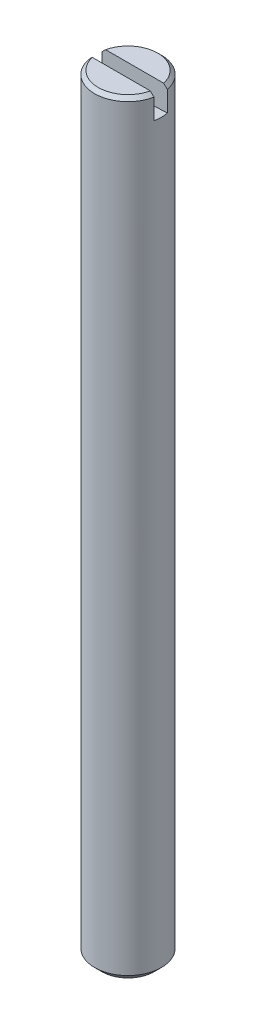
ISO-10303-21;
HEADER;
FILE_DESCRIPTION(('STEP AP214'),'2;1');
FILE_NAME('part.step','',(''),(''),'','','');
FILE_SCHEMA(('AUTOMOTIVE_DESIGN { 1 0 10303 214 1 1 1 1 }'));
ENDSEC;
DATA;
#1=APPLICATION_CONTEXT('core data for automotive mechanical design processes');
#2=APPLICATION_PROTOCOL_DEFINITION('international standard','automotive_design',2000,#1);
#3=PRODUCT_CONTEXT('',#1,'mechanical');
#4=PRODUCT('Part','Part','',(#3));
#5=PRODUCT_RELATED_PRODUCT_CATEGORY('part','',(#4));
#6=PRODUCT_DEFINITION_FORMATION('','',#4);
#7=PRODUCT_DEFINITION_CONTEXT('part definition',#1,'design');
#8=PRODUCT_DEFINITION('design','',#6,#7);
#9=PRODUCT_DEFINITION_SHAPE('','',#8);
#10=(LENGTH_UNIT() NAMED_UNIT(*) SI_UNIT(.MILLI.,.METRE.));
#11=(NAMED_UNIT(*) PLANE_ANGLE_UNIT() SI_UNIT($,.RADIAN.));
#12=(NAMED_UNIT(*) SI_UNIT($,.STERADIAN.) SOLID_ANGLE_UNIT());
#13=UNCERTAINTY_MEASURE_WITH_UNIT(LENGTH_MEASURE(1.E-05),#10,'distance_accuracy_value','');
#14=(GEOMETRIC_REPRESENTATION_CONTEXT(3) GLOBAL_UNCERTAINTY_ASSIGNED_CONTEXT((#13)) GLOBAL_UNIT_ASSIGNED_CONTEXT((#10,
#11,#12)) REPRESENTATION_CONTEXT('',''));
#15=CARTESIAN_POINT('',(0.,0.,0.));
#16=DIRECTION('',(0.,0.,1.));
#17=DIRECTION('',(1.,0.,0.));
#18=AXIS2_PLACEMENT_3D('',#15,#16,#17);
#19=CARTESIAN_POINT('',(0.,31.,0.));
#20=DIRECTION('',(0.,-1.,0.));
#21=DIRECTION('',(0.,0.,-1.));
#22=AXIS2_PLACEMENT_3D('',#19,#20,#21);
#23=PLANE('',#22);
#24=CARTESIAN_POINT('',(0.,31.0000000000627,0.));
#25=DIRECTION('',(0.,-1.,0.));
#26=DIRECTION('',(0.,0.,-1.));
#27=AXIS2_PLACEMENT_3D('',#24,#25,#26);
#28=CIRCLE('',#27,1.78549999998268);
#29=CARTESIAN_POINT('',(-1.74011788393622,31.0000000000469,-0.4));
#30=VERTEX_POINT('',#29);
#31=CARTESIAN_POINT('',(1.74011788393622,31.0000000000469,-0.4));
#32=VERTEX_POINT('',#31);
#33=EDGE_CURVE('E87',#30,#32,#28,.T.);
#34=ORIENTED_EDGE('',*,*,#33,.F.);
#35=DIRECTION('',(1.,0.,0.));
#36=VECTOR('',#35,1.);
#37=CARTESIAN_POINT('',(0.,31.,-0.4));
#38=LINE('',#37,#36);
#39=EDGE_CURVE('E19',#32,#30,#38,.F.);
#40=ORIENTED_EDGE('',*,*,#39,.F.);
#41=EDGE_LOOP('',(#34,#40));
#42=FACE_BOUND('',#41,.T.);
#43=ADVANCED_FACE('F14',(#42),#23,.F.);
#44=CARTESIAN_POINT('',(0.,31.,0.));
#45=DIRECTION('',(0.,-1.,0.));
#46=DIRECTION('',(0.,0.,-1.));
#47=AXIS2_PLACEMENT_3D('',#44,#45,#46);
#48=PLANE('',#47);
#49=DIRECTION('',(1.,0.,0.));
#50=VECTOR('',#49,1.);
#51=CARTESIAN_POINT('',(0.,31.,0.4));
#52=LINE('',#51,#50);
#53=CARTESIAN_POINT('',(-1.74011788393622,31.0000000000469,0.4));
#54=VERTEX_POINT('',#53);
#55=CARTESIAN_POINT('',(1.74011788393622,31.0000000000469,0.4));
#56=VERTEX_POINT('',#55);
#57=EDGE_CURVE('E81',#54,#56,#52,.T.);
#58=ORIENTED_EDGE('',*,*,#57,.F.);
#59=CARTESIAN_POINT('',(0.,31.0000000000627,0.));
#60=DIRECTION('',(0.,-1.,0.));
#61=DIRECTION('',(0.,0.,-1.));
#62=AXIS2_PLACEMENT_3D('',#59,#60,#61);
#63=CIRCLE('',#62,1.78549999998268);
#64=EDGE_CURVE('E74',#56,#54,#63,.T.);
#65=ORIENTED_EDGE('',*,*,#64,.F.);
#66=EDGE_LOOP('',(#58,#65));
#67=FACE_BOUND('',#66,.T.);
#68=ADVANCED_FACE('F86',(#67),#48,.F.);
#69=CARTESIAN_POINT('',(0.,30.7855000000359,0.));
#70=DIRECTION('',(0.,-1.,0.));
#71=DIRECTION('',(0.,0.,-1.));
#72=AXIS2_PLACEMENT_3D('',#69,#70,#71);
#73=CONICAL_SURFACE('',#72,1.9999999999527,0.785398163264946);
#74=CARTESIAN_POINT('',(-1.74011788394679,31.0000000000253,-0.399999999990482));
#75=CARTESIAN_POINT('',(-1.77674437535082,30.964298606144,-0.399999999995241));
#76=CARTESIAN_POINT('',(-1.8133471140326,30.928572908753,-0.399999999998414));
#77=CARTESIAN_POINT('',(-1.88650508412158,30.8570729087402,-0.400000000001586));
#78=CARTESIAN_POINT('',(-1.92306031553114,30.8212986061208,-0.400000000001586));
#79=CARTESIAN_POINT('',(-1.95959179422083,30.7854999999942,-0.4));
#80=B_SPLINE_CURVE_WITH_KNOTS('',3,(#74,#75,#76,#77,#78,#79),.UNSPECIFIED.,.F.,.F.,(4,2,4),(0.,
0.153443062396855,0.306886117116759),.UNSPECIFIED.);
#81=CARTESIAN_POINT('',(-1.95959179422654,30.7854999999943,-0.4));
#82=VERTEX_POINT('',#81);
#83=EDGE_CURVE('E85',#30,#82,#80,.T.);
#84=ORIENTED_EDGE('',*,*,#83,.F.);
#85=ORIENTED_EDGE('',*,*,#33,.T.);
#86=CARTESIAN_POINT('',(1.95959179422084,30.7854999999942,-0.4));
#87=CARTESIAN_POINT('',(1.9230603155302,30.8212986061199,-0.4));
#88=CARTESIAN_POINT('',(1.88650508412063,30.8570729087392,-0.4));
#89=CARTESIAN_POINT('',(1.81334711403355,30.9285729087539,-0.4));
#90=CARTESIAN_POINT('',(1.77674437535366,30.9642986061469,-0.4));
#91=CARTESIAN_POINT('',(1.74011788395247,31.0000000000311,-0.4));
#92=B_SPLINE_CURVE_WITH_KNOTS('',3,(#86,#87,#88,#89,#90,#91),.UNSPECIFIED.,.F.,.F.,(4,2,4),(0.,
0.153443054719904,0.306886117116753),.UNSPECIFIED.);
#93=CARTESIAN_POINT('',(1.95959179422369,30.7854999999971,-0.4));
#94=VERTEX_POINT('',#93);
#95=EDGE_CURVE('E112',#94,#32,#92,.T.);
#96=ORIENTED_EDGE('',*,*,#95,.F.);
#97=CARTESIAN_POINT('',(0.,30.7855,0.));
#98=DIRECTION('',(0.,-1.,0.));
#99=DIRECTION('',(0.,0.,-1.));
#100=AXIS2_PLACEMENT_3D('',#97,#98,#99);
#101=CIRCLE('',#100,2.);
#102=EDGE_CURVE('E101',#82,#94,#101,.T.);
#103=ORIENTED_EDGE('',*,*,#102,.F.);
#104=EDGE_LOOP('',(#84,#85,#96,#103));
#105=FACE_BOUND('',#104,.T.);
#106=ADVANCED_FACE('F128',(#105),#73,.T.);
#107=CARTESIAN_POINT('',(0.,61.,-0.4));
#108=DIRECTION('',(0.,0.,1.));
#109=DIRECTION('',(1.,0.,0.));
#110=AXIS2_PLACEMENT_3D('',#107,#108,#109);
#111=PLANE('',#110);
#112=ORIENTED_EDGE('',*,*,#39,.T.);
#113=ORIENTED_EDGE('',*,*,#83,.T.);
#114=DIRECTION('',(0.,1.,0.));
#115=VECTOR('',#114,1.);
#116=CARTESIAN_POINT('',(-1.95959179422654,61.,-0.4));
#117=LINE('',#116,#115);
#118=CARTESIAN_POINT('',(-1.95959179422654,29.5610114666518,-0.4));
#119=VERTEX_POINT('',#118);
#120=EDGE_CURVE('E58',#82,#119,#117,.F.);
#121=ORIENTED_EDGE('',*,*,#120,.T.);
#122=CARTESIAN_POINT('',(0.,61.,-0.4));
#123=DIRECTION('',(0.,0.,-1.));
#124=DIRECTION('',(-1.,0.,0.));
#125=AXIS2_PLACEMENT_3D('',#122,#123,#124);
#126=CIRCLE('',#125,31.5);
#127=CARTESIAN_POINT('',(1.95959179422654,29.5610114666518,-0.4));
#128=VERTEX_POINT('',#127);
#129=EDGE_CURVE('E109',#119,#128,#126,.F.);
#130=ORIENTED_EDGE('',*,*,#129,.T.);
#131=DIRECTION('',(0.,1.,0.));
#132=VECTOR('',#131,1.);
#133=CARTESIAN_POINT('',(1.95959179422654,61.,-0.4));
#134=LINE('',#133,#132);
#135=EDGE_CURVE('E110',#128,#94,#134,.T.);
#136=ORIENTED_EDGE('',*,*,#135,.T.);
#137=ORIENTED_EDGE('',*,*,#95,.T.);
#138=EDGE_LOOP('',(#112,#113,#121,#130,#136,#137));
#139=FACE_BOUND('',#138,.T.);
#140=ADVANCED_FACE('F124',(#139),#111,.T.);
#141=CARTESIAN_POINT('',(0.,30.7855000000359,0.));
#142=DIRECTION('',(0.,-1.,0.));
#143=DIRECTION('',(0.,0.,-1.));
#144=AXIS2_PLACEMENT_3D('',#141,#142,#143);
#145=CONICAL_SURFACE('',#144,1.9999999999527,0.785398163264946);
#146=ORIENTED_EDGE('',*,*,#64,.T.);
#147=CARTESIAN_POINT('',(-1.74011788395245,31.0000000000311,0.4));
#148=CARTESIAN_POINT('',(-1.77674437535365,30.9642986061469,0.4));
#149=CARTESIAN_POINT('',(-1.81334711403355,30.928572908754,0.4));
#150=CARTESIAN_POINT('',(-1.88650508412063,30.8570729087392,0.4));
#151=CARTESIAN_POINT('',(-1.9230603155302,30.8212986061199,0.4));
#152=CARTESIAN_POINT('',(-1.95959179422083,30.7854999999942,0.4));
#153=B_SPLINE_CURVE_WITH_KNOTS('',3,(#147,#148,#149,#150,#151,#152),.UNSPECIFIED.,.F.,.F.,(4,2,
4),(0.,0.153443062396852,0.306886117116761),.UNSPECIFIED.);
#154=CARTESIAN_POINT('',(-1.95959179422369,30.7854999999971,0.4));
#155=VERTEX_POINT('',#154);
#156=EDGE_CURVE('E34',#54,#155,#153,.T.);
#157=ORIENTED_EDGE('',*,*,#156,.T.);
#158=CARTESIAN_POINT('',(0.,30.7855,0.));
#159=DIRECTION('',(0.,-1.,0.));
#160=DIRECTION('',(0.,0.,-1.));
#161=AXIS2_PLACEMENT_3D('',#158,#159,#160);
#162=CIRCLE('',#161,2.);
#163=CARTESIAN_POINT('',(1.95959179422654,30.7854999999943,0.4));
#164=VERTEX_POINT('',#163);
#165=EDGE_CURVE('E75',#164,#155,#162,.T.);
#166=ORIENTED_EDGE('',*,*,#165,.F.);
#167=CARTESIAN_POINT('',(1.95959179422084,30.7854999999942,0.4));
#168=CARTESIAN_POINT('',(1.9230603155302,30.8212986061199,0.4));
#169=CARTESIAN_POINT('',(1.88650508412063,30.8570729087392,0.4));
#170=CARTESIAN_POINT('',(1.81334711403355,30.928572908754,0.4));
#171=CARTESIAN_POINT('',(1.77674437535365,30.9642986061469,0.4));
#172=CARTESIAN_POINT('',(1.74011788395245,31.0000000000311,0.4));
#173=B_SPLINE_CURVE_WITH_KNOTS('',3,(#167,#168,#169,#170,#171,#172),.UNSPECIFIED.,.F.,.F.,(4,2,
4),(0.,0.153443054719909,0.306886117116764),.UNSPECIFIED.);
#174=EDGE_CURVE('E70',#164,#56,#173,.T.);
#175=ORIENTED_EDGE('',*,*,#174,.T.);
#176=EDGE_LOOP('',(#146,#157,#166,#175));
#177=FACE_BOUND('',#176,.T.);
#178=ADVANCED_FACE('F72',(#177),#145,.T.);
#179=CARTESIAN_POINT('',(0.,61.,0.4));
#180=DIRECTION('',(0.,0.,1.));
#181=DIRECTION('',(1.,0.,0.));
#182=AXIS2_PLACEMENT_3D('',#179,#180,#181);
#183=PLANE('',#182);
#184=ORIENTED_EDGE('',*,*,#57,.T.);
#185=ORIENTED_EDGE('',*,*,#174,.F.);
#186=DIRECTION('',(0.,1.,0.));
#187=VECTOR('',#186,1.);
#188=CARTESIAN_POINT('',(1.95959179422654,61.,0.4));
#189=LINE('',#188,#187);
#190=CARTESIAN_POINT('',(1.95959179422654,29.5610114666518,0.4));
#191=VERTEX_POINT('',#190);
#192=EDGE_CURVE('E78',#191,#164,#189,.T.);
#193=ORIENTED_EDGE('',*,*,#192,.F.);
#194=CARTESIAN_POINT('',(0.,61.,0.4));
#195=DIRECTION('',(0.,0.,-1.));
#196=DIRECTION('',(-1.,0.,0.));
#197=AXIS2_PLACEMENT_3D('',#194,#195,#196);
#198=CIRCLE('',#197,31.5);
#199=CARTESIAN_POINT('',(-1.95959179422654,29.5610114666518,0.4));
#200=VERTEX_POINT('',#199);
#201=EDGE_CURVE('E106',#200,#191,#198,.F.);
#202=ORIENTED_EDGE('',*,*,#201,.F.);
#203=DIRECTION('',(0.,1.,0.));
#204=VECTOR('',#203,1.);
#205=CARTESIAN_POINT('',(-1.95959179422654,61.,0.4));
#206=LINE('',#205,#204);
#207=EDGE_CURVE('E104',#155,#200,#206,.F.);
#208=ORIENTED_EDGE('',*,*,#207,.F.);
#209=ORIENTED_EDGE('',*,*,#156,.F.);
#210=EDGE_LOOP('',(#184,#185,#193,#202,#208,#209));
#211=FACE_BOUND('',#210,.T.);
#212=ADVANCED_FACE('F82',(#211),#183,.F.);
#213=CARTESIAN_POINT('',(0.,61.,0.4));
#214=DIRECTION('',(0.,0.,-1.));
#215=DIRECTION('',(-1.,0.,0.));
#216=AXIS2_PLACEMENT_3D('',#213,#214,#215);
#217=CYLINDRICAL_SURFACE('',#216,31.5);
#218=CARTESIAN_POINT('',(1.95959179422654,29.5610114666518,-0.4));
#219=CARTESIAN_POINT('',(1.97091486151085,29.5617184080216,-0.344561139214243));
#220=CARTESIAN_POINT('',(1.97987306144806,29.562281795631,-0.288637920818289));
#221=CARTESIAN_POINT('',(1.99302430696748,29.5631121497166,-0.1762131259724));
#222=CARTESIAN_POINT('',(1.99721579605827,29.5633790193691,-0.119711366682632));
#223=CARTESIAN_POINT('',(2.0007609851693,29.5636046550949,-0.00749894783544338));
#224=CARTESIAN_POINT('',(2.00019410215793,29.5635684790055,0.0482092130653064));
#225=CARTESIAN_POINT('',(1.99441663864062,29.5632012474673,0.15936012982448));
#226=CARTESIAN_POINT('',(1.98920814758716,29.5628703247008,0.21480299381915));
#227=CARTESIAN_POINT('',(1.97576492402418,29.562023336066,0.313516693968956));
#228=CARTESIAN_POINT('',(1.96839158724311,29.561560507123,0.356906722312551));
#229=CARTESIAN_POINT('',(1.95959179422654,29.5610114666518,0.4));
#230=B_SPLINE_CURVE_WITH_KNOTS('',3,(#218,#219,#220,#221,#222,#223,#224,#225,#226,#227,#228,
#229),.UNSPECIFIED.,.F.,.F.,(4,2,2,2,2,4),(0.,0.169712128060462,0.33947965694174,
0.506419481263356,0.673284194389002,0.805229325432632),.UNSPECIFIED.);
#231=EDGE_CURVE('E25',#128,#191,#230,.T.);
#232=ORIENTED_EDGE('',*,*,#231,.F.);
#233=ORIENTED_EDGE('',*,*,#129,.F.);
#234=CARTESIAN_POINT('',(-1.95959179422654,29.5610114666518,0.4));
#235=CARTESIAN_POINT('',(-1.97091486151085,29.5617184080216,0.344561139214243));
#236=CARTESIAN_POINT('',(-1.97987306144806,29.562281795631,0.288637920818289));
#237=CARTESIAN_POINT('',(-1.99302430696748,29.5631121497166,0.176213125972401));
#238=CARTESIAN_POINT('',(-1.99721579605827,29.5633790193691,0.119711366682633));
#239=CARTESIAN_POINT('',(-2.0007609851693,29.5636046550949,0.00749894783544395));
#240=CARTESIAN_POINT('',(-2.00019410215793,29.5635684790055,-0.0482092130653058));
#241=CARTESIAN_POINT('',(-1.99441663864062,29.5632012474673,-0.159360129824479));
#242=CARTESIAN_POINT('',(-1.98920814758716,29.5628703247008,-0.214802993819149));
#243=CARTESIAN_POINT('',(-1.97576492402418,29.562023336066,-0.313516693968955));
#244=CARTESIAN_POINT('',(-1.96839158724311,29.561560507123,-0.356906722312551));
#245=CARTESIAN_POINT('',(-1.95959179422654,29.5610114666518,-0.4));
#246=B_SPLINE_CURVE_WITH_KNOTS('',3,(#234,#235,#236,#237,#238,#239,#240,#241,#242,#243,#244,
#245),.UNSPECIFIED.,.F.,.F.,(4,2,2,2,2,4),(0.,0.169712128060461,0.33947965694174,
0.506419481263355,0.673284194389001,0.805229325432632),.UNSPECIFIED.);
#247=EDGE_CURVE('E9',#200,#119,#246,.T.);
#248=ORIENTED_EDGE('',*,*,#247,.F.);
#249=ORIENTED_EDGE('',*,*,#201,.T.);
#250=EDGE_LOOP('',(#232,#233,#248,#249));
#251=FACE_BOUND('',#250,.T.);
#252=ADVANCED_FACE('F151',(#251),#217,.F.);
#253=CARTESIAN_POINT('',(0.,21.5,0.));
#254=DIRECTION('',(0.,-1.,0.));
#255=DIRECTION('',(0.,0.,-1.));
#256=AXIS2_PLACEMENT_3D('',#253,#254,#255);
#257=CYLINDRICAL_SURFACE('',#256,2.);
#258=ORIENTED_EDGE('',*,*,#231,.T.);
#259=ORIENTED_EDGE('',*,*,#192,.T.);
#260=ORIENTED_EDGE('',*,*,#165,.T.);
#261=ORIENTED_EDGE('',*,*,#207,.T.);
#262=ORIENTED_EDGE('',*,*,#247,.T.);
#263=ORIENTED_EDGE('',*,*,#120,.F.);
#264=ORIENTED_EDGE('',*,*,#102,.T.);
#265=ORIENTED_EDGE('',*,*,#135,.F.);
#266=EDGE_LOOP('',(#258,#259,#260,#261,#262,#263,#264,#265));
#267=FACE_BOUND('',#266,.T.);
#268=CARTESIAN_POINT('',(0.,-14.5705,0.));
#269=DIRECTION('',(0.,-1.,0.));
#270=DIRECTION('',(0.,0.,-1.));
#271=AXIS2_PLACEMENT_3D('',#268,#269,#270);
#272=CIRCLE('',#271,2.);
#273=CARTESIAN_POINT('',(0.,-14.5705,-2.));
#274=VERTEX_POINT('',#273);
#275=EDGE_CURVE('E103',#274,#274,#272,.T.);
#276=ORIENTED_EDGE('',*,*,#275,.F.);
#277=EDGE_LOOP('',(#276));
#278=FACE_BOUND('',#277,.T.);
#279=ADVANCED_FACE('F16',(#267,#278),#257,.T.);
#280=CARTESIAN_POINT('',(1.5705,-15.,0.));
#281=DIRECTION('',(0.,1.,0.));
#282=DIRECTION('',(0.,0.,1.));
#283=AXIS2_PLACEMENT_3D('',#280,#281,#282);
#284=PLANE('',#283);
#285=CARTESIAN_POINT('',(0.,-15.0000000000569,0.));
#286=DIRECTION('',(0.,1.,0.));
#287=DIRECTION('',(-1.,0.,0.));
#288=AXIS2_PLACEMENT_3D('',#285,#286,#287);
#289=CIRCLE('',#288,1.57050000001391);
#290=CARTESIAN_POINT('',(-1.57050000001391,-15.0000000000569,0.));
#291=VERTEX_POINT('',#290);
#292=EDGE_CURVE('E171',#291,#291,#289,.T.);
#293=ORIENTED_EDGE('',*,*,#292,.F.);
#294=EDGE_LOOP('',(#293));
#295=FACE_BOUND('',#294,.T.);
#296=ADVANCED_FACE('F157',(#295),#284,.F.);
#297=CARTESIAN_POINT('',(0.,-14.5705000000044,0.));
#298=DIRECTION('',(0.,1.,0.));
#299=DIRECTION('',(-1.,0.,0.));
#300=AXIS2_PLACEMENT_3D('',#297,#298,#299);
#301=CONICAL_SURFACE('',#300,2.00000000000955,0.785398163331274);
#302=ORIENTED_EDGE('',*,*,#275,.T.);
#303=EDGE_LOOP('',(#302));
#304=FACE_BOUND('',#303,.T.);
#305=ORIENTED_EDGE('',*,*,#292,.T.);
#306=EDGE_LOOP('',(#305));
#307=FACE_BOUND('',#306,.T.);
#308=ADVANCED_FACE('F177',(#304,#307),#301,.T.);
#309=CLOSED_SHELL('',(#43,#68,#106,#140,#178,#212,#252,#279,#296,#308));
#310=MANIFOLD_SOLID_BREP('B1',#309);
#311=ADVANCED_BREP_SHAPE_REPRESENTATION('',(#18,#310),#14);
#312=SHAPE_DEFINITION_REPRESENTATION(#9,#311);
ENDSEC;
END-ISO-10303-21;
